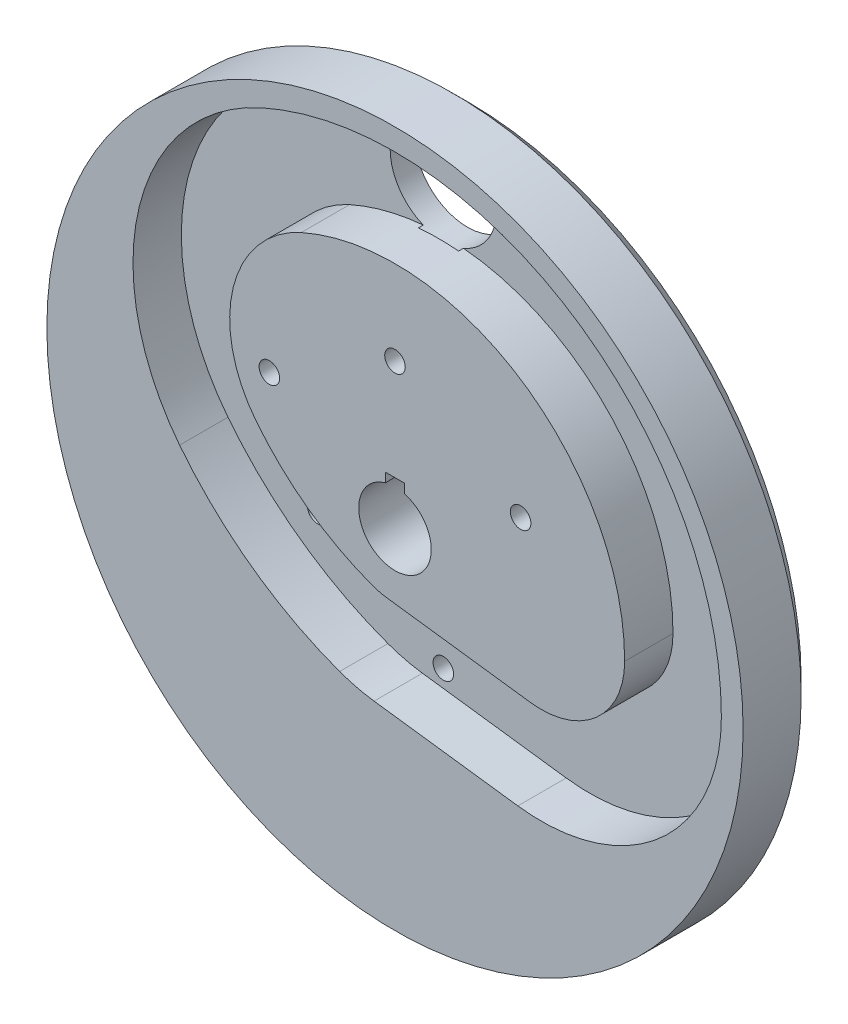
ISO-10303-21;
HEADER;
FILE_DESCRIPTION(('STEP AP214'),'2;1');
FILE_NAME('part.step','',(''),(''),'','','');
FILE_SCHEMA(('AUTOMOTIVE_DESIGN { 1 0 10303 214 1 1 1 1 }'));
ENDSEC;
DATA;
#1=APPLICATION_CONTEXT('core data for automotive mechanical design processes');
#2=APPLICATION_PROTOCOL_DEFINITION('international standard','automotive_design',2000,#1);
#3=PRODUCT_CONTEXT('',#1,'mechanical');
#4=PRODUCT('Part','Part','',(#3));
#5=PRODUCT_RELATED_PRODUCT_CATEGORY('part','',(#4));
#6=PRODUCT_DEFINITION_FORMATION('','',#4);
#7=PRODUCT_DEFINITION_CONTEXT('part definition',#1,'design');
#8=PRODUCT_DEFINITION('design','',#6,#7);
#9=PRODUCT_DEFINITION_SHAPE('','',#8);
#10=(LENGTH_UNIT() NAMED_UNIT(*) SI_UNIT(.MILLI.,.METRE.));
#11=(NAMED_UNIT(*) PLANE_ANGLE_UNIT() SI_UNIT($,.RADIAN.));
#12=(NAMED_UNIT(*) SI_UNIT($,.STERADIAN.) SOLID_ANGLE_UNIT());
#13=UNCERTAINTY_MEASURE_WITH_UNIT(LENGTH_MEASURE(1.E-05),#10,'distance_accuracy_value','');
#14=(GEOMETRIC_REPRESENTATION_CONTEXT(3) GLOBAL_UNCERTAINTY_ASSIGNED_CONTEXT((#13)) GLOBAL_UNIT_ASSIGNED_CONTEXT((#10,
#11,#12)) REPRESENTATION_CONTEXT('',''));
#15=CARTESIAN_POINT('',(0.,0.,0.));
#16=DIRECTION('',(0.,0.,1.));
#17=DIRECTION('',(1.,0.,0.));
#18=AXIS2_PLACEMENT_3D('',#15,#16,#17);
#19=CARTESIAN_POINT('',(0.,0.,-30.));
#20=DIRECTION('',(0.,0.,1.));
#21=DIRECTION('',(1.,0.,0.));
#22=AXIS2_PLACEMENT_3D('',#19,#20,#21);
#23=CYLINDRICAL_SURFACE('',#22,144.);
#24=CARTESIAN_POINT('',(0.,0.,-24.));
#25=DIRECTION('',(0.,0.,1.));
#26=DIRECTION('',(1.,0.,0.));
#27=AXIS2_PLACEMENT_3D('',#24,#25,#26);
#28=CIRCLE('',#27,144.);
#29=CARTESIAN_POINT('',(144.,0.,-24.));
#30=VERTEX_POINT('',#29);
#31=EDGE_CURVE('E31',#30,#30,#28,.T.);
#32=ORIENTED_EDGE('',*,*,#31,.T.);
#33=EDGE_LOOP('',(#32));
#34=FACE_BOUND('',#33,.T.);
#35=CARTESIAN_POINT('',(0.,0.,0.));
#36=DIRECTION('',(0.,0.,1.));
#37=DIRECTION('',(1.,0.,0.));
#38=AXIS2_PLACEMENT_3D('',#35,#36,#37);
#39=CIRCLE('',#38,144.);
#40=CARTESIAN_POINT('',(144.,0.,0.));
#41=VERTEX_POINT('',#40);
#42=EDGE_CURVE('E330',#41,#41,#39,.T.);
#43=ORIENTED_EDGE('',*,*,#42,.F.);
#44=EDGE_LOOP('',(#43));
#45=FACE_BOUND('',#44,.T.);
#46=ADVANCED_FACE('F24',(#34,#45),#23,.T.);
#47=CARTESIAN_POINT('',(0.,0.,-30.));
#48=DIRECTION('',(0.,0.,1.));
#49=DIRECTION('',(1.,0.,0.));
#50=AXIS2_PLACEMENT_3D('',#47,#48,#49);
#51=PLANE('',#50);
#52=CARTESIAN_POINT('',(0.,0.,-30.));
#53=DIRECTION('',(0.,0.,1.));
#54=DIRECTION('',(1.,0.,0.));
#55=AXIS2_PLACEMENT_3D('',#52,#53,#54);
#56=CIRCLE('',#55,138.);
#57=CARTESIAN_POINT('',(138.,0.,-30.));
#58=VERTEX_POINT('',#57);
#59=EDGE_CURVE('E11',#58,#58,#56,.F.);
#60=ORIENTED_EDGE('',*,*,#59,.T.);
#61=EDGE_LOOP('',(#60));
#62=FACE_BOUND('',#61,.T.);
#63=CARTESIAN_POINT('',(0.,115.,-30.));
#64=DIRECTION('',(0.,0.,-1.));
#65=DIRECTION('',(-1.,0.,0.));
#66=AXIS2_PLACEMENT_3D('',#63,#64,#65);
#67=CIRCLE('',#66,22.);
#68=CARTESIAN_POINT('',(-22.,115.,-30.));
#69=VERTEX_POINT('',#68);
#70=EDGE_CURVE('E473',#69,#69,#67,.T.);
#71=ORIENTED_EDGE('',*,*,#70,.F.);
#72=EDGE_LOOP('',(#71));
#73=FACE_BOUND('',#72,.T.);
#74=CARTESIAN_POINT('',(0.,-60.,-30.));
#75=DIRECTION('',(0.,0.,1.));
#76=DIRECTION('',(1.,0.,0.));
#77=AXIS2_PLACEMENT_3D('',#74,#75,#76);
#78=CIRCLE('',#77,4.25);
#79=CARTESIAN_POINT('',(4.25,-60.,-30.));
#80=VERTEX_POINT('',#79);
#81=EDGE_CURVE('E183',#80,#80,#78,.T.);
#82=ORIENTED_EDGE('',*,*,#81,.T.);
#83=EDGE_LOOP('',(#82));
#84=FACE_BOUND('',#83,.T.);
#85=CARTESIAN_POINT('',(-51.9615242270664,-29.9999999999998,-30.));
#86=DIRECTION('',(0.,0.,1.));
#87=DIRECTION('',(1.,0.,0.));
#88=AXIS2_PLACEMENT_3D('',#85,#86,#87);
#89=CIRCLE('',#88,4.24999999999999);
#90=CARTESIAN_POINT('',(-47.7115242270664,-29.9999999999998,-30.));
#91=VERTEX_POINT('',#90);
#92=EDGE_CURVE('E193',#91,#91,#89,.T.);
#93=ORIENTED_EDGE('',*,*,#92,.T.);
#94=EDGE_LOOP('',(#93));
#95=FACE_BOUND('',#94,.T.);
#96=CARTESIAN_POINT('',(0.,60.,-30.));
#97=DIRECTION('',(0.,0.,1.));
#98=DIRECTION('',(1.,0.,0.));
#99=AXIS2_PLACEMENT_3D('',#96,#97,#98);
#100=CIRCLE('',#99,4.24999999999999);
#101=CARTESIAN_POINT('',(4.24999999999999,60.,-30.));
#102=VERTEX_POINT('',#101);
#103=EDGE_CURVE('E194',#102,#102,#100,.T.);
#104=ORIENTED_EDGE('',*,*,#103,.T.);
#105=EDGE_LOOP('',(#104));
#106=FACE_BOUND('',#105,.T.);
#107=CARTESIAN_POINT('',(51.9615242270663,29.9999999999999,-30.));
#108=DIRECTION('',(0.,0.,1.));
#109=DIRECTION('',(1.,0.,0.));
#110=AXIS2_PLACEMENT_3D('',#107,#108,#109);
#111=CIRCLE('',#110,4.25);
#112=CARTESIAN_POINT('',(56.2115242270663,29.9999999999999,-30.));
#113=VERTEX_POINT('',#112);
#114=EDGE_CURVE('E200',#113,#113,#111,.T.);
#115=ORIENTED_EDGE('',*,*,#114,.T.);
#116=EDGE_LOOP('',(#115));
#117=FACE_BOUND('',#116,.T.);
#118=CARTESIAN_POINT('',(-51.9615242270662,30.0000000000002,-30.));
#119=DIRECTION('',(0.,0.,1.));
#120=DIRECTION('',(1.,0.,0.));
#121=AXIS2_PLACEMENT_3D('',#118,#119,#120);
#122=CIRCLE('',#121,4.24999999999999);
#123=CARTESIAN_POINT('',(-47.7115242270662,30.0000000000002,-30.));
#124=VERTEX_POINT('',#123);
#125=EDGE_CURVE('E206',#124,#124,#122,.T.);
#126=ORIENTED_EDGE('',*,*,#125,.T.);
#127=EDGE_LOOP('',(#126));
#128=FACE_BOUND('',#127,.T.);
#129=DIRECTION('',(0.,1.,0.));
#130=VECTOR('',#129,1.);
#131=CARTESIAN_POINT('',(4.,18.3,-30.));
#132=LINE('',#131,#130);
#133=CARTESIAN_POINT('',(4.,14.456832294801,-30.));
#134=VERTEX_POINT('',#133);
#135=CARTESIAN_POINT('',(4.,18.3,-30.));
#136=VERTEX_POINT('',#135);
#137=EDGE_CURVE('E230',#134,#136,#132,.T.);
#138=ORIENTED_EDGE('',*,*,#137,.T.);
#139=DIRECTION('',(-1.,0.,0.));
#140=VECTOR('',#139,1.);
#141=CARTESIAN_POINT('',(-4.,18.3,-30.));
#142=LINE('',#141,#140);
#143=CARTESIAN_POINT('',(-4.,18.3,-30.));
#144=VERTEX_POINT('',#143);
#145=EDGE_CURVE('E223',#136,#144,#142,.T.);
#146=ORIENTED_EDGE('',*,*,#145,.T.);
#147=DIRECTION('',(0.,-1.,0.));
#148=VECTOR('',#147,1.);
#149=CARTESIAN_POINT('',(-4.,18.3,-30.));
#150=LINE('',#149,#148);
#151=CARTESIAN_POINT('',(-4.,14.456832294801,-30.));
#152=VERTEX_POINT('',#151);
#153=EDGE_CURVE('E226',#144,#152,#150,.T.);
#154=ORIENTED_EDGE('',*,*,#153,.T.);
#155=CARTESIAN_POINT('',(0.,0.,-30.));
#156=DIRECTION('',(0.,0.,1.));
#157=DIRECTION('',(1.,0.,0.));
#158=AXIS2_PLACEMENT_3D('',#155,#156,#157);
#159=CIRCLE('',#158,15.);
#160=EDGE_CURVE('E45',#152,#134,#159,.T.);
#161=ORIENTED_EDGE('',*,*,#160,.T.);
#162=EDGE_LOOP('',(#138,#146,#154,#161));
#163=FACE_BOUND('',#162,.T.);
#164=ADVANCED_FACE('F367',(#62,#73,#84,#95,#106,#117,#128,#163),#51,.F.);
#165=CARTESIAN_POINT('',(0.,0.,0.));
#166=DIRECTION('',(0.,0.,1.));
#167=DIRECTION('',(1.,0.,0.));
#168=AXIS2_PLACEMENT_3D('',#165,#166,#167);
#169=PLANE('',#168);
#170=CARTESIAN_POINT('',(60.5,0.,0.));
#171=DIRECTION('',(0.,0.,1.));
#172=DIRECTION('',(1.,0.,0.));
#173=AXIS2_PLACEMENT_3D('',#170,#171,#172);
#174=CIRCLE('',#173,74.5002588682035);
#175=CARTESIAN_POINT('',(50.8168577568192,-73.8682971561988,0.));
#176=VERTEX_POINT('',#175);
#177=CARTESIAN_POINT('',(135.000258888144,0.,0.));
#178=VERTEX_POINT('',#177);
#179=EDGE_CURVE('E282',#176,#178,#174,.T.);
#180=ORIENTED_EDGE('',*,*,#179,.F.);
#181=DIRECTION('',(0.991517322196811,-0.129974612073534,0.));
#182=VECTOR('',#181,1.);
#183=CARTESIAN_POINT('',(-8.65172179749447,-66.0727646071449,0.));
#184=LINE('',#183,#182);
#185=CARTESIAN_POINT('',(-8.65172179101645,-66.0727645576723,0.));
#186=VERTEX_POINT('',#185);
#187=EDGE_CURVE('E306',#186,#176,#184,.T.);
#188=ORIENTED_EDGE('',*,*,#187,.F.);
#189=CARTESIAN_POINT('',(0.,0.,0.));
#190=DIRECTION('',(0.,0.,1.));
#191=DIRECTION('',(1.,0.,0.));
#192=AXIS2_PLACEMENT_3D('',#189,#190,#191);
#193=CIRCLE('',#192,66.6367954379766);
#194=CARTESIAN_POINT('',(-22.8994855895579,-62.5785592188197,0.));
#195=VERTEX_POINT('',#194);
#196=EDGE_CURVE('E303',#195,#186,#193,.T.);
#197=ORIENTED_EDGE('',*,*,#196,.F.);
#198=CARTESIAN_POINT('',(28.55,78.02,0.));
#199=DIRECTION('',(0.,0.,1.));
#200=DIRECTION('',(1.,0.,0.));
#201=AXIS2_PLACEMENT_3D('',#198,#199,#200);
#202=CIRCLE('',#201,149.716413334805);
#203=CARTESIAN_POINT('',(-89.0842271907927,-14.5931362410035,0.));
#204=VERTEX_POINT('',#203);
#205=EDGE_CURVE('E300',#204,#195,#202,.T.);
#206=ORIENTED_EDGE('',*,*,#205,.F.);
#207=CARTESIAN_POINT('',(-18.37,41.08,0.));
#208=DIRECTION('',(0.,0.,1.));
#209=DIRECTION('',(1.,0.,0.));
#210=AXIS2_PLACEMENT_3D('',#207,#208,#209);
#211=CIRCLE('',#210,90.0000001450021);
#212=CARTESIAN_POINT('',(-55.1097886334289,123.239527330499,0.));
#213=VERTEX_POINT('',#212);
#214=EDGE_CURVE('E297',#213,#204,#211,.T.);
#215=ORIENTED_EDGE('',*,*,#214,.F.);
#216=CARTESIAN_POINT('',(0.,0.,0.));
#217=DIRECTION('',(0.,0.,1.));
#218=DIRECTION('',(1.,0.,0.));
#219=AXIS2_PLACEMENT_3D('',#216,#217,#218);
#220=CIRCLE('',#219,135.000258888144);
#221=EDGE_CURVE('E294',#178,#213,#220,.T.);
#222=ORIENTED_EDGE('',*,*,#221,.F.);
#223=EDGE_LOOP('',(#180,#188,#197,#206,#215,#222));
#224=FACE_BOUND('',#223,.T.);
#225=ORIENTED_EDGE('',*,*,#42,.T.);
#226=EDGE_LOOP('',(#225));
#227=FACE_BOUND('',#226,.T.);
#228=ADVANCED_FACE('F371',(#224,#227),#169,.T.);
#229=CARTESIAN_POINT('',(60.5,0.,-20.));
#230=DIRECTION('',(0.,0.,1.));
#231=DIRECTION('',(1.,0.,0.));
#232=AXIS2_PLACEMENT_3D('',#229,#230,#231);
#233=CYLINDRICAL_SURFACE('',#232,74.5002588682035);
#234=ORIENTED_EDGE('',*,*,#179,.T.);
#235=DIRECTION('',(0.,0.,1.));
#236=VECTOR('',#235,1.);
#237=CARTESIAN_POINT('',(135.000258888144,0.,-20.));
#238=LINE('',#237,#236);
#239=CARTESIAN_POINT('',(135.000258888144,0.,-20.));
#240=VERTEX_POINT('',#239);
#241=EDGE_CURVE('E327',#240,#178,#238,.T.);
#242=ORIENTED_EDGE('',*,*,#241,.F.);
#243=CARTESIAN_POINT('',(60.5,0.,-20.));
#244=DIRECTION('',(0.,0.,1.));
#245=DIRECTION('',(1.,0.,0.));
#246=AXIS2_PLACEMENT_3D('',#243,#244,#245);
#247=CIRCLE('',#246,74.5002588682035);
#248=CARTESIAN_POINT('',(50.8168577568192,-73.8682971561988,-20.));
#249=VERTEX_POINT('',#248);
#250=EDGE_CURVE('E309',#249,#240,#247,.T.);
#251=ORIENTED_EDGE('',*,*,#250,.F.);
#252=DIRECTION('',(0.,0.,1.));
#253=VECTOR('',#252,1.);
#254=CARTESIAN_POINT('',(50.8168577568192,-73.8682971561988,-20.));
#255=LINE('',#254,#253);
#256=EDGE_CURVE('E328',#249,#176,#255,.T.);
#257=ORIENTED_EDGE('',*,*,#256,.T.);
#258=EDGE_LOOP('',(#234,#242,#251,#257));
#259=FACE_BOUND('',#258,.T.);
#260=ADVANCED_FACE('F376',(#259),#233,.F.);
#261=CARTESIAN_POINT('',(-8.65172179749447,-66.0727646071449,-20.));
#262=DIRECTION('',(-0.129974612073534,-0.991517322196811,0.));
#263=DIRECTION('',(0.991517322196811,-0.129974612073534,0.));
#264=AXIS2_PLACEMENT_3D('',#261,#262,#263);
#265=PLANE('',#264);
#266=ORIENTED_EDGE('',*,*,#187,.T.);
#267=ORIENTED_EDGE('',*,*,#256,.F.);
#268=DIRECTION('',(0.991517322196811,-0.129974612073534,0.));
#269=VECTOR('',#268,1.);
#270=CARTESIAN_POINT('',(-8.65172179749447,-66.0727646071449,-20.));
#271=LINE('',#270,#269);
#272=CARTESIAN_POINT('',(-8.65172179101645,-66.0727645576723,-20.));
#273=VERTEX_POINT('',#272);
#274=EDGE_CURVE('E324',#273,#249,#271,.T.);
#275=ORIENTED_EDGE('',*,*,#274,.F.);
#276=DIRECTION('',(0.,0.,1.));
#277=VECTOR('',#276,1.);
#278=CARTESIAN_POINT('',(-8.65172179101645,-66.0727645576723,-20.));
#279=LINE('',#278,#277);
#280=EDGE_CURVE('E331',#273,#186,#279,.T.);
#281=ORIENTED_EDGE('',*,*,#280,.T.);
#282=EDGE_LOOP('',(#266,#267,#275,#281));
#283=FACE_BOUND('',#282,.T.);
#284=ADVANCED_FACE('F384',(#283),#265,.F.);
#285=CARTESIAN_POINT('',(0.,0.,-20.));
#286=DIRECTION('',(0.,0.,1.));
#287=DIRECTION('',(1.,0.,0.));
#288=AXIS2_PLACEMENT_3D('',#285,#286,#287);
#289=CYLINDRICAL_SURFACE('',#288,66.6367954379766);
#290=ORIENTED_EDGE('',*,*,#196,.T.);
#291=ORIENTED_EDGE('',*,*,#280,.F.);
#292=CARTESIAN_POINT('',(0.,0.,-20.));
#293=DIRECTION('',(0.,0.,1.));
#294=DIRECTION('',(1.,0.,0.));
#295=AXIS2_PLACEMENT_3D('',#292,#293,#294);
#296=CIRCLE('',#295,66.6367954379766);
#297=CARTESIAN_POINT('',(-22.8994855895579,-62.5785592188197,-20.));
#298=VERTEX_POINT('',#297);
#299=EDGE_CURVE('E321',#298,#273,#296,.T.);
#300=ORIENTED_EDGE('',*,*,#299,.F.);
#301=DIRECTION('',(0.,0.,1.));
#302=VECTOR('',#301,1.);
#303=CARTESIAN_POINT('',(-22.8994855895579,-62.5785592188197,-20.));
#304=LINE('',#303,#302);
#305=EDGE_CURVE('E333',#298,#195,#304,.T.);
#306=ORIENTED_EDGE('',*,*,#305,.T.);
#307=EDGE_LOOP('',(#290,#291,#300,#306));
#308=FACE_BOUND('',#307,.T.);
#309=ADVANCED_FACE('F396',(#308),#289,.F.);
#310=CARTESIAN_POINT('',(28.55,78.02,-20.));
#311=DIRECTION('',(0.,0.,1.));
#312=DIRECTION('',(1.,0.,0.));
#313=AXIS2_PLACEMENT_3D('',#310,#311,#312);
#314=CYLINDRICAL_SURFACE('',#313,149.716413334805);
#315=ORIENTED_EDGE('',*,*,#205,.T.);
#316=ORIENTED_EDGE('',*,*,#305,.F.);
#317=CARTESIAN_POINT('',(28.55,78.02,-20.));
#318=DIRECTION('',(0.,0.,1.));
#319=DIRECTION('',(1.,0.,0.));
#320=AXIS2_PLACEMENT_3D('',#317,#318,#319);
#321=CIRCLE('',#320,149.716413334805);
#322=CARTESIAN_POINT('',(-89.0842271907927,-14.5931362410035,-20.));
#323=VERTEX_POINT('',#322);
#324=EDGE_CURVE('E318',#323,#298,#321,.T.);
#325=ORIENTED_EDGE('',*,*,#324,.F.);
#326=DIRECTION('',(0.,0.,1.));
#327=VECTOR('',#326,1.);
#328=CARTESIAN_POINT('',(-89.0842271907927,-14.5931362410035,-20.));
#329=LINE('',#328,#327);
#330=EDGE_CURVE('E335',#323,#204,#329,.T.);
#331=ORIENTED_EDGE('',*,*,#330,.T.);
#332=EDGE_LOOP('',(#315,#316,#325,#331));
#333=FACE_BOUND('',#332,.T.);
#334=ADVANCED_FACE('F392',(#333),#314,.F.);
#335=CARTESIAN_POINT('',(-18.37,41.08,-20.));
#336=DIRECTION('',(0.,0.,1.));
#337=DIRECTION('',(1.,0.,0.));
#338=AXIS2_PLACEMENT_3D('',#335,#336,#337);
#339=CYLINDRICAL_SURFACE('',#338,90.0000001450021);
#340=ORIENTED_EDGE('',*,*,#214,.T.);
#341=ORIENTED_EDGE('',*,*,#330,.F.);
#342=CARTESIAN_POINT('',(-18.37,41.08,-20.));
#343=DIRECTION('',(0.,0.,1.));
#344=DIRECTION('',(1.,0.,0.));
#345=AXIS2_PLACEMENT_3D('',#342,#343,#344);
#346=CIRCLE('',#345,90.0000001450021);
#347=CARTESIAN_POINT('',(-55.1097886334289,123.239527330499,-20.));
#348=VERTEX_POINT('',#347);
#349=EDGE_CURVE('E315',#348,#323,#346,.T.);
#350=ORIENTED_EDGE('',*,*,#349,.F.);
#351=DIRECTION('',(0.,0.,1.));
#352=VECTOR('',#351,1.);
#353=CARTESIAN_POINT('',(-55.1097886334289,123.239527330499,-20.));
#354=LINE('',#353,#352);
#355=EDGE_CURVE('E337',#348,#213,#354,.T.);
#356=ORIENTED_EDGE('',*,*,#355,.T.);
#357=EDGE_LOOP('',(#340,#341,#350,#356));
#358=FACE_BOUND('',#357,.T.);
#359=ADVANCED_FACE('F389',(#358),#339,.F.);
#360=CARTESIAN_POINT('',(0.,0.,-20.));
#361=DIRECTION('',(0.,0.,1.));
#362=DIRECTION('',(1.,0.,0.));
#363=AXIS2_PLACEMENT_3D('',#360,#361,#362);
#364=CYLINDRICAL_SURFACE('',#363,135.000258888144);
#365=CARTESIAN_POINT('',(0.,0.,-20.));
#366=DIRECTION('',(0.,0.,1.));
#367=DIRECTION('',(1.,0.,0.));
#368=AXIS2_PLACEMENT_3D('',#365,#366,#367);
#369=CIRCLE('',#368,135.000258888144);
#370=CARTESIAN_POINT('',(-9.92287142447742,134.635086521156,-20.));
#371=VERTEX_POINT('',#370);
#372=EDGE_CURVE('E178',#371,#348,#369,.T.);
#373=ORIENTED_EDGE('',*,*,#372,.F.);
#374=DIRECTION('',(0.,0.,-1.));
#375=VECTOR('',#374,1.);
#376=CARTESIAN_POINT('',(-9.92287142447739,134.635086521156,-24.));
#377=LINE('',#376,#375);
#378=CARTESIAN_POINT('',(-9.92287142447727,134.635086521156,-18.));
#379=VERTEX_POINT('',#378);
#380=EDGE_CURVE('E171',#371,#379,#377,.F.);
#381=ORIENTED_EDGE('',*,*,#380,.T.);
#382=CARTESIAN_POINT('',(0.,0.,-18.));
#383=DIRECTION('',(0.,0.,-1.));
#384=DIRECTION('',(-1.,0.,0.));
#385=AXIS2_PLACEMENT_3D('',#382,#383,#384);
#386=CIRCLE('',#385,135.000258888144);
#387=CARTESIAN_POINT('',(9.92287142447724,134.635086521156,-18.));
#388=VERTEX_POINT('',#387);
#389=EDGE_CURVE('E160',#388,#379,#386,.F.);
#390=ORIENTED_EDGE('',*,*,#389,.F.);
#391=DIRECTION('',(0.,0.,-1.));
#392=VECTOR('',#391,1.);
#393=CARTESIAN_POINT('',(9.92287142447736,134.635086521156,-24.));
#394=LINE('',#393,#392);
#395=CARTESIAN_POINT('',(9.92287142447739,134.635086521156,-20.));
#396=VERTEX_POINT('',#395);
#397=EDGE_CURVE('E173',#388,#396,#394,.T.);
#398=ORIENTED_EDGE('',*,*,#397,.T.);
#399=EDGE_CURVE('E312',#240,#396,#369,.T.);
#400=ORIENTED_EDGE('',*,*,#399,.F.);
#401=ORIENTED_EDGE('',*,*,#241,.T.);
#402=ORIENTED_EDGE('',*,*,#221,.T.);
#403=ORIENTED_EDGE('',*,*,#355,.F.);
#404=EDGE_LOOP('',(#373,#381,#390,#398,#400,#401,#402,#403));
#405=FACE_BOUND('',#404,.T.);
#406=ADVANCED_FACE('F176',(#405),#364,.F.);
#407=CARTESIAN_POINT('',(60.5,0.,-20.));
#408=DIRECTION('',(0.,0.,1.));
#409=DIRECTION('',(1.,0.,0.));
#410=AXIS2_PLACEMENT_3D('',#407,#408,#409);
#411=PLANE('',#410);
#412=CARTESIAN_POINT('',(0.,115.,-20.));
#413=DIRECTION('',(0.,0.,1.));
#414=DIRECTION('',(1.,0.,0.));
#415=AXIS2_PLACEMENT_3D('',#412,#413,#414);
#416=CIRCLE('',#415,22.);
#417=CARTESIAN_POINT('',(-8.31902660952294,94.6335129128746,-20.));
#418=VERTEX_POINT('',#417);
#419=EDGE_CURVE('E180',#371,#418,#416,.T.);
#420=ORIENTED_EDGE('',*,*,#419,.F.);
#421=ORIENTED_EDGE('',*,*,#372,.T.);
#422=ORIENTED_EDGE('',*,*,#349,.T.);
#423=ORIENTED_EDGE('',*,*,#324,.T.);
#424=ORIENTED_EDGE('',*,*,#299,.T.);
#425=ORIENTED_EDGE('',*,*,#274,.T.);
#426=ORIENTED_EDGE('',*,*,#250,.T.);
#427=ORIENTED_EDGE('',*,*,#399,.T.);
#428=CARTESIAN_POINT('',(8.31902660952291,94.6335129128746,-20.));
#429=VERTEX_POINT('',#428);
#430=EDGE_CURVE('E167',#429,#396,#416,.T.);
#431=ORIENTED_EDGE('',*,*,#430,.F.);
#432=CARTESIAN_POINT('',(0.,0.,-20.));
#433=DIRECTION('',(0.,0.,1.));
#434=DIRECTION('',(1.,0.,0.));
#435=AXIS2_PLACEMENT_3D('',#432,#433,#434);
#436=CIRCLE('',#435,94.9984629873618);
#437=CARTESIAN_POINT('',(94.9984629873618,0.,-20.));
#438=VERTEX_POINT('',#437);
#439=EDGE_CURVE('E264',#438,#429,#436,.T.);
#440=ORIENTED_EDGE('',*,*,#439,.F.);
#441=CARTESIAN_POINT('',(60.5,0.,-20.));
#442=DIRECTION('',(0.,0.,1.));
#443=DIRECTION('',(1.,0.,0.));
#444=AXIS2_PLACEMENT_3D('',#441,#442,#443);
#445=CIRCLE('',#444,34.4984629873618);
#446=CARTESIAN_POINT('',(56.0160762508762,-34.2058237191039,-20.));
#447=VERTEX_POINT('',#446);
#448=EDGE_CURVE('E260',#447,#438,#445,.T.);
#449=ORIENTED_EDGE('',*,*,#448,.F.);
#450=DIRECTION('',(0.991517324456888,-0.129974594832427,0.));
#451=VECTOR('',#450,1.);
#452=CARTESIAN_POINT('',(-3.46187333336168,-26.4090639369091,-20.));
#453=LINE('',#452,#451);
#454=CARTESIAN_POINT('',(-3.46187333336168,-26.4090639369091,-20.));
#455=VERTEX_POINT('',#454);
#456=EDGE_CURVE('E276',#455,#447,#453,.T.);
#457=ORIENTED_EDGE('',*,*,#456,.F.);
#458=CARTESIAN_POINT('',(0.,0.,-20.));
#459=DIRECTION('',(0.,0.,1.));
#460=DIRECTION('',(1.,0.,0.));
#461=AXIS2_PLACEMENT_3D('',#458,#459,#460);
#462=CIRCLE('',#461,26.635);
#463=CARTESIAN_POINT('',(-9.15903694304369,-25.0107030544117,-20.));
#464=VERTEX_POINT('',#463);
#465=EDGE_CURVE('E273',#464,#455,#462,.T.);
#466=ORIENTED_EDGE('',*,*,#465,.F.);
#467=CARTESIAN_POINT('',(28.55,78.02,-20.));
#468=DIRECTION('',(0.,0.,1.));
#469=DIRECTION('',(1.,0.,0.));
#470=AXIS2_PLACEMENT_3D('',#467,#468,#469);
#471=CIRCLE('',#470,109.714617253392);
#472=CARTESIAN_POINT('',(-57.6542706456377,10.1515908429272,-20.));
#473=VERTEX_POINT('',#472);
#474=EDGE_CURVE('E270',#473,#464,#471,.T.);
#475=ORIENTED_EDGE('',*,*,#474,.F.);
#476=CARTESIAN_POINT('',(-18.37,41.08,-20.));
#477=DIRECTION('',(0.,0.,1.));
#478=DIRECTION('',(1.,0.,0.));
#479=AXIS2_PLACEMENT_3D('',#476,#477,#478);
#480=CIRCLE('',#479,49.9982040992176);
#481=CARTESIAN_POINT('',(-38.7802605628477,86.7225424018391,-20.));
#482=VERTEX_POINT('',#481);
#483=EDGE_CURVE('E267',#482,#473,#480,.T.);
#484=ORIENTED_EDGE('',*,*,#483,.F.);
#485=EDGE_CURVE('E263',#418,#482,#436,.T.);
#486=ORIENTED_EDGE('',*,*,#485,.F.);
#487=EDGE_LOOP('',(#420,#421,#422,#423,#424,#425,#426,#427,#431,#440,#449,#457,#466,#475,#484,#486));
#488=FACE_BOUND('',#487,.T.);
#489=CARTESIAN_POINT('',(0.,-60.,-20.));
#490=DIRECTION('',(0.,0.,1.));
#491=DIRECTION('',(1.,0.,0.));
#492=AXIS2_PLACEMENT_3D('',#489,#490,#491);
#493=CIRCLE('',#492,4.24999999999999);
#494=CARTESIAN_POINT('',(4.24999999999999,-60.,-20.));
#495=VERTEX_POINT('',#494);
#496=EDGE_CURVE('E179',#495,#495,#493,.T.);
#497=ORIENTED_EDGE('',*,*,#496,.F.);
#498=EDGE_LOOP('',(#497));
#499=FACE_BOUND('',#498,.T.);
#500=CARTESIAN_POINT('',(-51.9615242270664,-29.9999999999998,-20.));
#501=DIRECTION('',(0.,0.,1.));
#502=DIRECTION('',(1.,0.,0.));
#503=AXIS2_PLACEMENT_3D('',#500,#501,#502);
#504=CIRCLE('',#503,4.24999999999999);
#505=CARTESIAN_POINT('',(-47.7115242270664,-29.9999999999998,-20.));
#506=VERTEX_POINT('',#505);
#507=EDGE_CURVE('E190',#506,#506,#504,.T.);
#508=ORIENTED_EDGE('',*,*,#507,.F.);
#509=EDGE_LOOP('',(#508));
#510=FACE_BOUND('',#509,.T.);
#511=ADVANCED_FACE('F388',(#488,#499,#510),#411,.T.);
#512=CARTESIAN_POINT('',(60.5,0.,-20.));
#513=DIRECTION('',(0.,0.,1.));
#514=DIRECTION('',(1.,0.,0.));
#515=AXIS2_PLACEMENT_3D('',#512,#513,#514);
#516=CYLINDRICAL_SURFACE('',#515,34.4984629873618);
#517=CARTESIAN_POINT('',(60.5,0.,0.));
#518=DIRECTION('',(0.,0.,1.));
#519=DIRECTION('',(1.,0.,0.));
#520=AXIS2_PLACEMENT_3D('',#517,#518,#519);
#521=CIRCLE('',#520,34.4984629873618);
#522=CARTESIAN_POINT('',(56.0160762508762,-34.2058237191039,0.));
#523=VERTEX_POINT('',#522);
#524=CARTESIAN_POINT('',(94.9984629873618,0.,0.));
#525=VERTEX_POINT('',#524);
#526=EDGE_CURVE('E236',#523,#525,#521,.T.);
#527=ORIENTED_EDGE('',*,*,#526,.F.);
#528=DIRECTION('',(0.,0.,1.));
#529=VECTOR('',#528,1.);
#530=CARTESIAN_POINT('',(56.0160762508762,-34.2058237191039,-20.));
#531=LINE('',#530,#529);
#532=EDGE_CURVE('E280',#447,#523,#531,.T.);
#533=ORIENTED_EDGE('',*,*,#532,.F.);
#534=ORIENTED_EDGE('',*,*,#448,.T.);
#535=DIRECTION('',(0.,0.,1.));
#536=VECTOR('',#535,1.);
#537=CARTESIAN_POINT('',(94.9984629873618,0.,-20.));
#538=LINE('',#537,#536);
#539=EDGE_CURVE('E279',#438,#525,#538,.T.);
#540=ORIENTED_EDGE('',*,*,#539,.T.);
#541=EDGE_LOOP('',(#527,#533,#534,#540));
#542=FACE_BOUND('',#541,.T.);
#543=ADVANCED_FACE('F406',(#542),#516,.T.);
#544=CARTESIAN_POINT('',(-3.46187333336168,-26.4090639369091,-20.));
#545=DIRECTION('',(-0.129974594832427,-0.991517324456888,0.));
#546=DIRECTION('',(0.991517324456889,-0.129974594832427,0.));
#547=AXIS2_PLACEMENT_3D('',#544,#545,#546);
#548=PLANE('',#547);
#549=DIRECTION('',(0.991517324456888,-0.129974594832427,0.));
#550=VECTOR('',#549,1.);
#551=CARTESIAN_POINT('',(-3.46187333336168,-26.4090639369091,0.));
#552=LINE('',#551,#550);
#553=CARTESIAN_POINT('',(-3.46187333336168,-26.4090639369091,0.));
#554=VERTEX_POINT('',#553);
#555=EDGE_CURVE('E257',#554,#523,#552,.T.);
#556=ORIENTED_EDGE('',*,*,#555,.F.);
#557=DIRECTION('',(0.,0.,1.));
#558=VECTOR('',#557,1.);
#559=CARTESIAN_POINT('',(-3.46187333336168,-26.4090639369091,-20.));
#560=LINE('',#559,#558);
#561=EDGE_CURVE('E283',#455,#554,#560,.T.);
#562=ORIENTED_EDGE('',*,*,#561,.F.);
#563=ORIENTED_EDGE('',*,*,#456,.T.);
#564=ORIENTED_EDGE('',*,*,#532,.T.);
#565=EDGE_LOOP('',(#556,#562,#563,#564));
#566=FACE_BOUND('',#565,.T.);
#567=ADVANCED_FACE('F410',(#566),#548,.T.);
#568=CARTESIAN_POINT('',(0.,0.,-20.));
#569=DIRECTION('',(0.,0.,1.));
#570=DIRECTION('',(1.,0.,0.));
#571=AXIS2_PLACEMENT_3D('',#568,#569,#570);
#572=CYLINDRICAL_SURFACE('',#571,26.635);
#573=CARTESIAN_POINT('',(0.,0.,0.));
#574=DIRECTION('',(0.,0.,1.));
#575=DIRECTION('',(1.,0.,0.));
#576=AXIS2_PLACEMENT_3D('',#573,#574,#575);
#577=CIRCLE('',#576,26.635);
#578=CARTESIAN_POINT('',(-9.15903694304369,-25.0107030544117,0.));
#579=VERTEX_POINT('',#578);
#580=EDGE_CURVE('E254',#579,#554,#577,.T.);
#581=ORIENTED_EDGE('',*,*,#580,.F.);
#582=DIRECTION('',(0.,0.,1.));
#583=VECTOR('',#582,1.);
#584=CARTESIAN_POINT('',(-9.15903694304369,-25.0107030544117,-20.));
#585=LINE('',#584,#583);
#586=EDGE_CURVE('E285',#464,#579,#585,.T.);
#587=ORIENTED_EDGE('',*,*,#586,.F.);
#588=ORIENTED_EDGE('',*,*,#465,.T.);
#589=ORIENTED_EDGE('',*,*,#561,.T.);
#590=EDGE_LOOP('',(#581,#587,#588,#589));
#591=FACE_BOUND('',#590,.T.);
#592=ADVANCED_FACE('F423',(#591),#572,.T.);
#593=CARTESIAN_POINT('',(28.55,78.02,-20.));
#594=DIRECTION('',(0.,0.,1.));
#595=DIRECTION('',(1.,0.,0.));
#596=AXIS2_PLACEMENT_3D('',#593,#594,#595);
#597=CYLINDRICAL_SURFACE('',#596,109.714617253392);
#598=CARTESIAN_POINT('',(28.55,78.02,0.));
#599=DIRECTION('',(0.,0.,1.));
#600=DIRECTION('',(1.,0.,0.));
#601=AXIS2_PLACEMENT_3D('',#598,#599,#600);
#602=CIRCLE('',#601,109.714617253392);
#603=CARTESIAN_POINT('',(-57.6542706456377,10.1515908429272,0.));
#604=VERTEX_POINT('',#603);
#605=EDGE_CURVE('E251',#604,#579,#602,.T.);
#606=ORIENTED_EDGE('',*,*,#605,.F.);
#607=DIRECTION('',(0.,0.,1.));
#608=VECTOR('',#607,1.);
#609=CARTESIAN_POINT('',(-57.6542706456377,10.1515908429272,-20.));
#610=LINE('',#609,#608);
#611=EDGE_CURVE('E287',#473,#604,#610,.T.);
#612=ORIENTED_EDGE('',*,*,#611,.F.);
#613=ORIENTED_EDGE('',*,*,#474,.T.);
#614=ORIENTED_EDGE('',*,*,#586,.T.);
#615=EDGE_LOOP('',(#606,#612,#613,#614));
#616=FACE_BOUND('',#615,.T.);
#617=ADVANCED_FACE('F419',(#616),#597,.T.);
#618=CARTESIAN_POINT('',(-18.37,41.08,-20.));
#619=DIRECTION('',(0.,0.,1.));
#620=DIRECTION('',(1.,0.,0.));
#621=AXIS2_PLACEMENT_3D('',#618,#619,#620);
#622=CYLINDRICAL_SURFACE('',#621,49.9982040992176);
#623=CARTESIAN_POINT('',(-18.37,41.08,0.));
#624=DIRECTION('',(0.,0.,1.));
#625=DIRECTION('',(1.,0.,0.));
#626=AXIS2_PLACEMENT_3D('',#623,#624,#625);
#627=CIRCLE('',#626,49.9982040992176);
#628=CARTESIAN_POINT('',(-38.7802605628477,86.7225424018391,0.));
#629=VERTEX_POINT('',#628);
#630=EDGE_CURVE('E248',#629,#604,#627,.T.);
#631=ORIENTED_EDGE('',*,*,#630,.F.);
#632=DIRECTION('',(0.,0.,1.));
#633=VECTOR('',#632,1.);
#634=CARTESIAN_POINT('',(-38.7802605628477,86.7225424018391,-20.));
#635=LINE('',#634,#633);
#636=EDGE_CURVE('E289',#482,#629,#635,.T.);
#637=ORIENTED_EDGE('',*,*,#636,.F.);
#638=ORIENTED_EDGE('',*,*,#483,.T.);
#639=ORIENTED_EDGE('',*,*,#611,.T.);
#640=EDGE_LOOP('',(#631,#637,#638,#639));
#641=FACE_BOUND('',#640,.T.);
#642=ADVANCED_FACE('F415',(#641),#622,.T.);
#643=CARTESIAN_POINT('',(0.,0.,-20.));
#644=DIRECTION('',(0.,0.,1.));
#645=DIRECTION('',(1.,0.,0.));
#646=AXIS2_PLACEMENT_3D('',#643,#644,#645);
#647=CYLINDRICAL_SURFACE('',#646,94.9984629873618);
#648=DIRECTION('',(0.,0.,-1.));
#649=VECTOR('',#648,1.);
#650=CARTESIAN_POINT('',(-8.31902660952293,94.6335129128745,-24.));
#651=LINE('',#650,#649);
#652=CARTESIAN_POINT('',(-8.31902660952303,94.6335129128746,-18.));
#653=VERTEX_POINT('',#652);
#654=EDGE_CURVE('E350',#418,#653,#651,.F.);
#655=ORIENTED_EDGE('',*,*,#654,.F.);
#656=ORIENTED_EDGE('',*,*,#485,.T.);
#657=ORIENTED_EDGE('',*,*,#636,.T.);
#658=CARTESIAN_POINT('',(0.,0.,0.));
#659=DIRECTION('',(0.,0.,1.));
#660=DIRECTION('',(1.,0.,0.));
#661=AXIS2_PLACEMENT_3D('',#658,#659,#660);
#662=CIRCLE('',#661,94.9984629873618);
#663=EDGE_CURVE('E245',#525,#629,#662,.T.);
#664=ORIENTED_EDGE('',*,*,#663,.F.);
#665=ORIENTED_EDGE('',*,*,#539,.F.);
#666=ORIENTED_EDGE('',*,*,#439,.T.);
#667=DIRECTION('',(0.,0.,-1.));
#668=VECTOR('',#667,1.);
#669=CARTESIAN_POINT('',(8.31902660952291,94.6335129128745,-24.));
#670=LINE('',#669,#668);
#671=CARTESIAN_POINT('',(8.31902660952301,94.6335129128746,-18.));
#672=VERTEX_POINT('',#671);
#673=EDGE_CURVE('E348',#672,#429,#670,.T.);
#674=ORIENTED_EDGE('',*,*,#673,.F.);
#675=CARTESIAN_POINT('',(0.,0.,-18.));
#676=DIRECTION('',(0.,0.,-1.));
#677=DIRECTION('',(-1.,0.,0.));
#678=AXIS2_PLACEMENT_3D('',#675,#676,#677);
#679=CIRCLE('',#678,94.9984629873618);
#680=EDGE_CURVE('E343',#672,#653,#679,.F.);
#681=ORIENTED_EDGE('',*,*,#680,.T.);
#682=EDGE_LOOP('',(#655,#656,#657,#664,#665,#666,#674,#681));
#683=FACE_BOUND('',#682,.T.);
#684=ADVANCED_FACE('F412',(#683),#647,.T.);
#685=CARTESIAN_POINT('',(0.,60.,0.));
#686=DIRECTION('',(0.,0.,1.));
#687=DIRECTION('',(1.,0.,0.));
#688=AXIS2_PLACEMENT_3D('',#685,#686,#687);
#689=CIRCLE('',#688,4.24999999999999);
#690=CARTESIAN_POINT('',(4.24999999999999,60.,0.));
#691=VERTEX_POINT('',#690);
#692=EDGE_CURVE('E197',#691,#691,#689,.T.);
#693=ORIENTED_EDGE('',*,*,#692,.F.);
#694=EDGE_LOOP('',(#693));
#695=FACE_BOUND('',#694,.T.);
#696=CARTESIAN_POINT('',(51.9615242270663,29.9999999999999,0.));
#697=DIRECTION('',(0.,0.,1.));
#698=DIRECTION('',(1.,0.,0.));
#699=AXIS2_PLACEMENT_3D('',#696,#697,#698);
#700=CIRCLE('',#699,4.24999999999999);
#701=CARTESIAN_POINT('',(56.2115242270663,29.9999999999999,0.));
#702=VERTEX_POINT('',#701);
#703=EDGE_CURVE('E203',#702,#702,#700,.T.);
#704=ORIENTED_EDGE('',*,*,#703,.F.);
#705=EDGE_LOOP('',(#704));
#706=FACE_BOUND('',#705,.T.);
#707=CARTESIAN_POINT('',(-51.9615242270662,30.0000000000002,0.));
#708=DIRECTION('',(0.,0.,1.));
#709=DIRECTION('',(1.,0.,0.));
#710=AXIS2_PLACEMENT_3D('',#707,#708,#709);
#711=CIRCLE('',#710,4.24999999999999);
#712=CARTESIAN_POINT('',(-47.7115242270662,30.0000000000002,0.));
#713=VERTEX_POINT('',#712);
#714=EDGE_CURVE('E209',#713,#713,#711,.T.);
#715=ORIENTED_EDGE('',*,*,#714,.F.);
#716=EDGE_LOOP('',(#715));
#717=FACE_BOUND('',#716,.T.);
#718=DIRECTION('',(-1.,0.,0.));
#719=VECTOR('',#718,1.);
#720=CARTESIAN_POINT('',(-4.,18.3,0.));
#721=LINE('',#720,#719);
#722=CARTESIAN_POINT('',(4.,18.3,0.));
#723=VERTEX_POINT('',#722);
#724=CARTESIAN_POINT('',(-4.,18.3,0.));
#725=VERTEX_POINT('',#724);
#726=EDGE_CURVE('E212',#723,#725,#721,.T.);
#727=ORIENTED_EDGE('',*,*,#726,.F.);
#728=DIRECTION('',(0.,1.,0.));
#729=VECTOR('',#728,1.);
#730=CARTESIAN_POINT('',(4.,18.3,0.));
#731=LINE('',#730,#729);
#732=CARTESIAN_POINT('',(4.,14.456832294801,0.));
#733=VERTEX_POINT('',#732);
#734=EDGE_CURVE('E220',#733,#723,#731,.T.);
#735=ORIENTED_EDGE('',*,*,#734,.F.);
#736=CARTESIAN_POINT('',(0.,0.,0.));
#737=DIRECTION('',(0.,0.,1.));
#738=DIRECTION('',(1.,0.,0.));
#739=AXIS2_PLACEMENT_3D('',#736,#737,#738);
#740=CIRCLE('',#739,15.);
#741=CARTESIAN_POINT('',(-4.,14.456832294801,0.));
#742=VERTEX_POINT('',#741);
#743=EDGE_CURVE('E217',#742,#733,#740,.T.);
#744=ORIENTED_EDGE('',*,*,#743,.F.);
#745=DIRECTION('',(0.,-1.,0.));
#746=VECTOR('',#745,1.);
#747=CARTESIAN_POINT('',(-4.,18.3,0.));
#748=LINE('',#747,#746);
#749=EDGE_CURVE('E214',#725,#742,#748,.T.);
#750=ORIENTED_EDGE('',*,*,#749,.F.);
#751=EDGE_LOOP('',(#727,#735,#744,#750));
#752=FACE_BOUND('',#751,.T.);
#753=ORIENTED_EDGE('',*,*,#555,.T.);
#754=ORIENTED_EDGE('',*,*,#526,.T.);
#755=ORIENTED_EDGE('',*,*,#663,.T.);
#756=ORIENTED_EDGE('',*,*,#630,.T.);
#757=ORIENTED_EDGE('',*,*,#605,.T.);
#758=ORIENTED_EDGE('',*,*,#580,.T.);
#759=EDGE_LOOP('',(#753,#754,#755,#756,#757,#758));
#760=FACE_BOUND('',#759,.T.);
#761=ADVANCED_FACE('F379',(#695,#706,#717,#752,#760),#169,.T.);
#762=CARTESIAN_POINT('',(-4.,18.3,-30.));
#763=DIRECTION('',(0.,1.,0.));
#764=DIRECTION('',(0.,0.,1.));
#765=AXIS2_PLACEMENT_3D('',#762,#763,#764);
#766=PLANE('',#765);
#767=ORIENTED_EDGE('',*,*,#726,.T.);
#768=DIRECTION('',(0.,0.,1.));
#769=VECTOR('',#768,1.);
#770=CARTESIAN_POINT('',(-4.,18.3,-30.));
#771=LINE('',#770,#769);
#772=EDGE_CURVE('E233',#144,#725,#771,.T.);
#773=ORIENTED_EDGE('',*,*,#772,.F.);
#774=ORIENTED_EDGE('',*,*,#145,.F.);
#775=DIRECTION('',(0.,0.,1.));
#776=VECTOR('',#775,1.);
#777=CARTESIAN_POINT('',(4.,18.3,-30.));
#778=LINE('',#777,#776);
#779=EDGE_CURVE('E234',#136,#723,#778,.T.);
#780=ORIENTED_EDGE('',*,*,#779,.T.);
#781=EDGE_LOOP('',(#767,#773,#774,#780));
#782=FACE_BOUND('',#781,.T.);
#783=ADVANCED_FACE('F431',(#782),#766,.F.);
#784=CARTESIAN_POINT('',(4.,18.3,-30.));
#785=DIRECTION('',(1.,0.,0.));
#786=DIRECTION('',(0.,0.,-1.));
#787=AXIS2_PLACEMENT_3D('',#784,#785,#786);
#788=PLANE('',#787);
#789=ORIENTED_EDGE('',*,*,#734,.T.);
#790=ORIENTED_EDGE('',*,*,#779,.F.);
#791=ORIENTED_EDGE('',*,*,#137,.F.);
#792=DIRECTION('',(0.,0.,1.));
#793=VECTOR('',#792,1.);
#794=CARTESIAN_POINT('',(4.,14.456832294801,-30.));
#795=LINE('',#794,#793);
#796=EDGE_CURVE('E237',#134,#733,#795,.T.);
#797=ORIENTED_EDGE('',*,*,#796,.T.);
#798=EDGE_LOOP('',(#789,#790,#791,#797));
#799=FACE_BOUND('',#798,.T.);
#800=ADVANCED_FACE('F434',(#799),#788,.F.);
#801=CARTESIAN_POINT('',(0.,0.,-30.));
#802=DIRECTION('',(0.,0.,1.));
#803=DIRECTION('',(1.,0.,0.));
#804=AXIS2_PLACEMENT_3D('',#801,#802,#803);
#805=CYLINDRICAL_SURFACE('',#804,15.);
#806=ORIENTED_EDGE('',*,*,#743,.T.);
#807=ORIENTED_EDGE('',*,*,#796,.F.);
#808=ORIENTED_EDGE('',*,*,#160,.F.);
#809=DIRECTION('',(0.,0.,1.));
#810=VECTOR('',#809,1.);
#811=CARTESIAN_POINT('',(-4.,14.456832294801,-30.));
#812=LINE('',#811,#810);
#813=EDGE_CURVE('E239',#152,#742,#812,.T.);
#814=ORIENTED_EDGE('',*,*,#813,.T.);
#815=EDGE_LOOP('',(#806,#807,#808,#814));
#816=FACE_BOUND('',#815,.T.);
#817=ADVANCED_FACE('F440',(#816),#805,.F.);
#818=CARTESIAN_POINT('',(-4.,18.3,-30.));
#819=DIRECTION('',(-1.,0.,0.));
#820=DIRECTION('',(0.,0.,1.));
#821=AXIS2_PLACEMENT_3D('',#818,#819,#820);
#822=PLANE('',#821);
#823=ORIENTED_EDGE('',*,*,#749,.T.);
#824=ORIENTED_EDGE('',*,*,#813,.F.);
#825=ORIENTED_EDGE('',*,*,#153,.F.);
#826=ORIENTED_EDGE('',*,*,#772,.T.);
#827=EDGE_LOOP('',(#823,#824,#825,#826));
#828=FACE_BOUND('',#827,.T.);
#829=ADVANCED_FACE('F436',(#828),#822,.F.);
#830=CARTESIAN_POINT('',(-51.9615242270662,30.0000000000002,0.));
#831=DIRECTION('',(0.,0.,1.));
#832=DIRECTION('',(1.,0.,0.));
#833=AXIS2_PLACEMENT_3D('',#830,#831,#832);
#834=CYLINDRICAL_SURFACE('',#833,4.24999999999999);
#835=ORIENTED_EDGE('',*,*,#125,.F.);
#836=EDGE_LOOP('',(#835));
#837=FACE_BOUND('',#836,.T.);
#838=ORIENTED_EDGE('',*,*,#714,.T.);
#839=EDGE_LOOP('',(#838));
#840=FACE_BOUND('',#839,.T.);
#841=ADVANCED_FACE('F439',(#837,#840),#834,.F.);
#842=CARTESIAN_POINT('',(51.9615242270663,29.9999999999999,0.));
#843=DIRECTION('',(0.,0.,1.));
#844=DIRECTION('',(1.,0.,0.));
#845=AXIS2_PLACEMENT_3D('',#842,#843,#844);
#846=CYLINDRICAL_SURFACE('',#845,4.24999999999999);
#847=ORIENTED_EDGE('',*,*,#114,.F.);
#848=EDGE_LOOP('',(#847));
#849=FACE_BOUND('',#848,.T.);
#850=ORIENTED_EDGE('',*,*,#703,.T.);
#851=EDGE_LOOP('',(#850));
#852=FACE_BOUND('',#851,.T.);
#853=ADVANCED_FACE('F449',(#849,#852),#846,.F.);
#854=CARTESIAN_POINT('',(0.,60.,0.));
#855=DIRECTION('',(0.,0.,1.));
#856=DIRECTION('',(1.,0.,0.));
#857=AXIS2_PLACEMENT_3D('',#854,#855,#856);
#858=CYLINDRICAL_SURFACE('',#857,4.24999999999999);
#859=ORIENTED_EDGE('',*,*,#103,.F.);
#860=EDGE_LOOP('',(#859));
#861=FACE_BOUND('',#860,.T.);
#862=ORIENTED_EDGE('',*,*,#692,.T.);
#863=EDGE_LOOP('',(#862));
#864=FACE_BOUND('',#863,.T.);
#865=ADVANCED_FACE('F453',(#861,#864),#858,.F.);
#866=CARTESIAN_POINT('',(-51.9615242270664,-29.9999999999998,-20.));
#867=DIRECTION('',(0.,0.,1.));
#868=DIRECTION('',(1.,0.,0.));
#869=AXIS2_PLACEMENT_3D('',#866,#867,#868);
#870=CYLINDRICAL_SURFACE('',#869,4.24999999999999);
#871=ORIENTED_EDGE('',*,*,#507,.T.);
#872=EDGE_LOOP('',(#871));
#873=FACE_BOUND('',#872,.T.);
#874=ORIENTED_EDGE('',*,*,#92,.F.);
#875=EDGE_LOOP('',(#874));
#876=FACE_BOUND('',#875,.T.);
#877=ADVANCED_FACE('F457',(#873,#876),#870,.F.);
#878=CARTESIAN_POINT('',(0.,-60.,-20.));
#879=DIRECTION('',(0.,0.,1.));
#880=DIRECTION('',(1.,0.,0.));
#881=AXIS2_PLACEMENT_3D('',#878,#879,#880);
#882=CYLINDRICAL_SURFACE('',#881,4.24999999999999);
#883=ORIENTED_EDGE('',*,*,#81,.F.);
#884=EDGE_LOOP('',(#883));
#885=FACE_BOUND('',#884,.T.);
#886=ORIENTED_EDGE('',*,*,#496,.T.);
#887=EDGE_LOOP('',(#886));
#888=FACE_BOUND('',#887,.T.);
#889=ADVANCED_FACE('F461',(#885,#888),#882,.F.);
#890=CARTESIAN_POINT('',(0.,115.,-18.));
#891=DIRECTION('',(0.,0.,-1.));
#892=DIRECTION('',(-1.,0.,0.));
#893=AXIS2_PLACEMENT_3D('',#890,#891,#892);
#894=CYLINDRICAL_SURFACE('',#893,22.);
#895=ORIENTED_EDGE('',*,*,#70,.T.);
#896=EDGE_LOOP('',(#895));
#897=FACE_BOUND('',#896,.T.);
#898=ORIENTED_EDGE('',*,*,#419,.T.);
#899=ORIENTED_EDGE('',*,*,#654,.T.);
#900=CARTESIAN_POINT('',(0.,115.,-18.));
#901=DIRECTION('',(0.,0.,-1.));
#902=DIRECTION('',(-1.,0.,0.));
#903=AXIS2_PLACEMENT_3D('',#900,#901,#902);
#904=CIRCLE('',#903,22.);
#905=EDGE_CURVE('E37',#672,#653,#904,.T.);
#906=ORIENTED_EDGE('',*,*,#905,.F.);
#907=ORIENTED_EDGE('',*,*,#673,.T.);
#908=ORIENTED_EDGE('',*,*,#430,.T.);
#909=ORIENTED_EDGE('',*,*,#397,.F.);
#910=EDGE_CURVE('E163',#379,#388,#904,.T.);
#911=ORIENTED_EDGE('',*,*,#910,.F.);
#912=ORIENTED_EDGE('',*,*,#380,.F.);
#913=EDGE_LOOP('',(#898,#899,#906,#907,#908,#909,#911,#912));
#914=FACE_BOUND('',#913,.T.);
#915=ADVANCED_FACE('F170',(#897,#914),#894,.F.);
#916=CARTESIAN_POINT('',(0.,115.,-18.));
#917=DIRECTION('',(0.,0.,-1.));
#918=DIRECTION('',(-1.,0.,0.));
#919=AXIS2_PLACEMENT_3D('',#916,#917,#918);
#920=PLANE('',#919);
#921=ORIENTED_EDGE('',*,*,#389,.T.);
#922=ORIENTED_EDGE('',*,*,#910,.T.);
#923=EDGE_LOOP('',(#921,#922));
#924=FACE_BOUND('',#923,.T.);
#925=ADVANCED_FACE('F162',(#924),#920,.T.);
#926=ORIENTED_EDGE('',*,*,#905,.T.);
#927=ORIENTED_EDGE('',*,*,#680,.F.);
#928=EDGE_LOOP('',(#926,#927));
#929=FACE_BOUND('',#928,.T.);
#930=ADVANCED_FACE('F358',(#929),#920,.T.);
#931=CARTESIAN_POINT('',(0.,0.,-24.));
#932=DIRECTION('',(0.,0.,1.));
#933=DIRECTION('',(1.,0.,0.));
#934=AXIS2_PLACEMENT_3D('',#931,#932,#933);
#935=CONICAL_SURFACE('',#934,144.,0.785398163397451);
#936=ORIENTED_EDGE('',*,*,#59,.F.);
#937=EDGE_LOOP('',(#936));
#938=FACE_BOUND('',#937,.T.);
#939=ORIENTED_EDGE('',*,*,#31,.F.);
#940=EDGE_LOOP('',(#939));
#941=FACE_BOUND('',#940,.T.);
#942=ADVANCED_FACE('F356',(#938,#941),#935,.T.);
#943=CLOSED_SHELL('',(#46,#164,#228,#260,#284,#309,#334,#359,#406,#511,#543,#567,#592,#617,#642,
#684,#761,#783,#800,#817,#829,#841,#853,#865,#877,#889,#915,#925,#930,#942));
#944=MANIFOLD_SOLID_BREP('B2',#943);
#945=ADVANCED_BREP_SHAPE_REPRESENTATION('',(#18,#944),#14);
#946=SHAPE_DEFINITION_REPRESENTATION(#9,#945);
ENDSEC;
END-ISO-10303-21;
